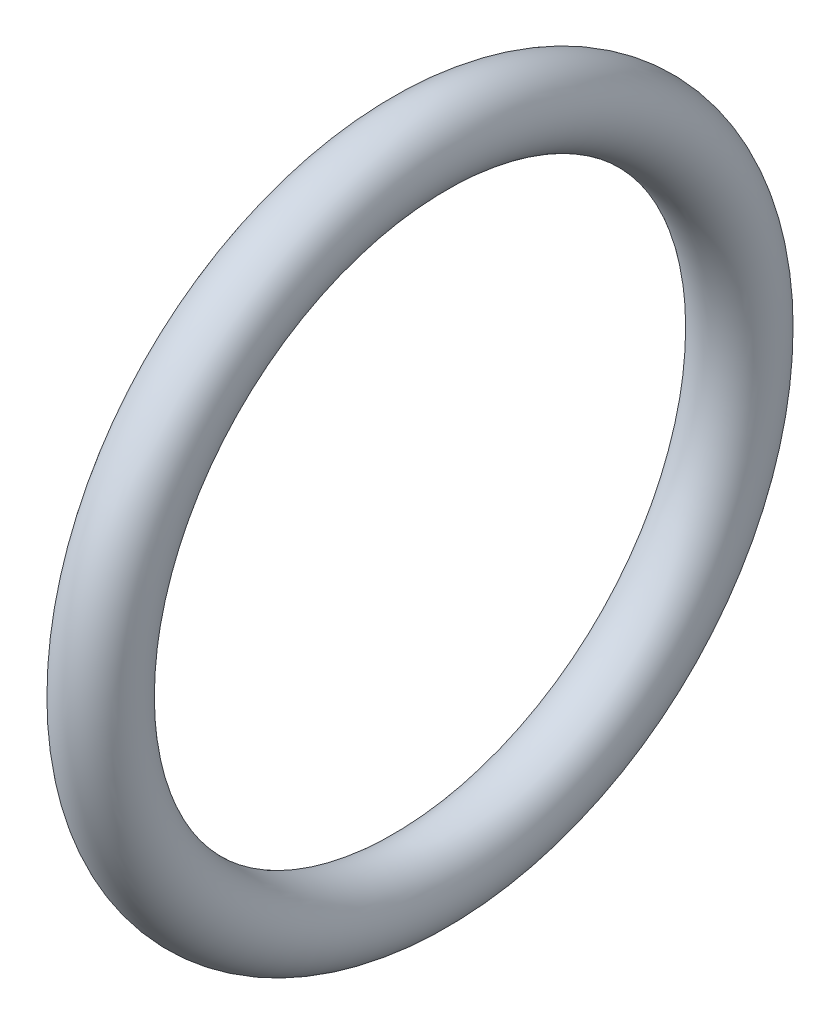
from build123d import *

# Parameters (mm, degrees)
SKETCH1_R = 1.1049


with BuildPart() as part:
    # Sketch1 → Base-Revolve (revolve)
    with BuildSketch(Plane.XY, mode=Mode.PRIVATE) as base_revolve_sk:
        with Locations((0, 9.2837)):
            Circle(SKETCH1_R)
    revolve(base_revolve_sk.sketch.rotate(Axis((0, 0, 0), (1, 0, 0)), 90), axis=Axis((0, 0, 0), (1, 0, 0)))


solid = part.part
